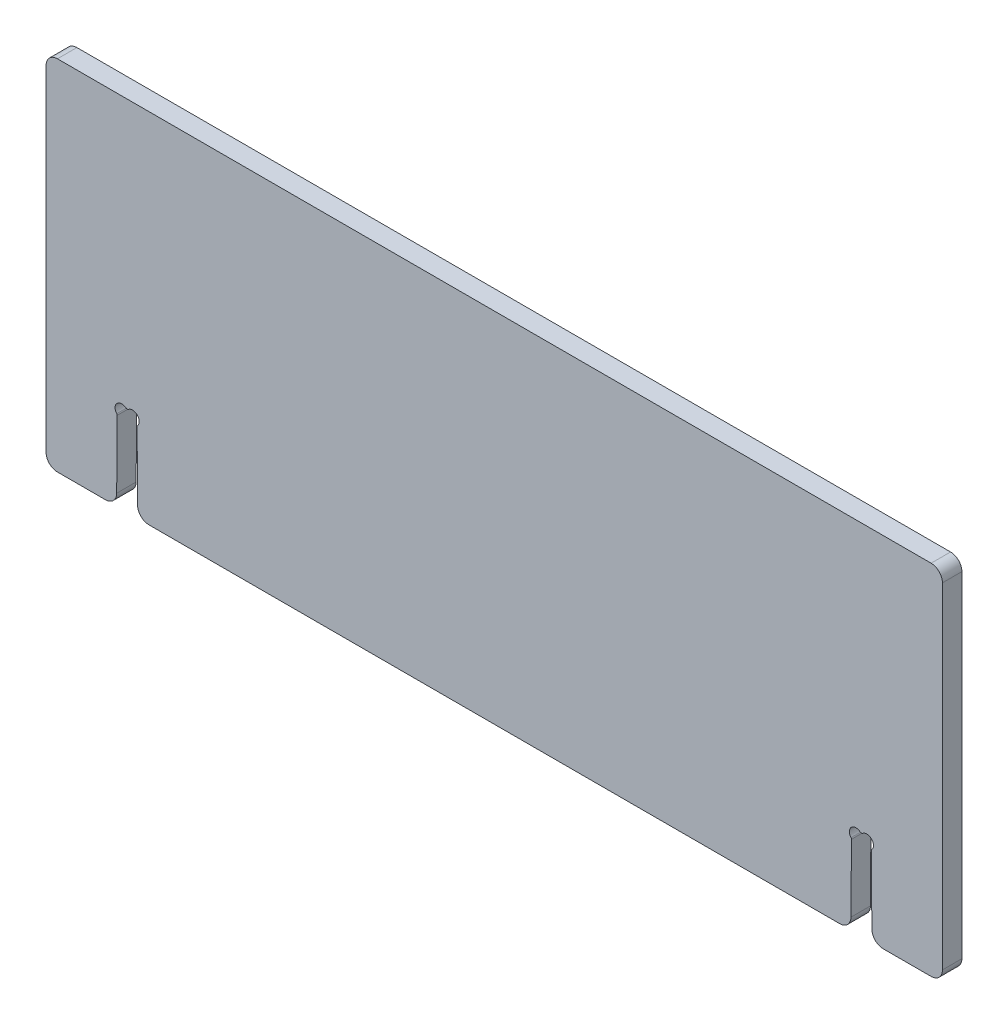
from build123d import *

# Parameters (mm, degrees)
ESQUISSE1_W         = 276.5
ESQUISSE1_H         = 220.8
BOSS_EXTRUDE1_DEPTH = 12
CUT_EXTRUDE1_DEPTH  = 355.046451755
CONG_1_R            = 7


with BuildPart() as part:
    # Esquisse1 → Boss-Extrude1 (new body)
    with BuildSketch(Plane.XY):
        with Locations((138.25, 110.4)):
            Rectangle(ESQUISSE1_W, ESQUISSE1_H)
    extrude(amount=BOSS_EXTRUDE1_DEPTH)

    # Esquisse2 → Cut-Extrude1 (cut, through all)
    with BuildSketch(Plane.XY.offset(12)):
        with BuildLine():
            Line((49.867332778, 55.2), (50.132667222, 55.2))
            ThreePointArc((50.132667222, 55.2), (50.514806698, 55.262472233), (50.857157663, 55.443384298))
            ThreePointArc((50.857157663, 55.443384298), (56.321786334, 54.981041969), (56.438077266, 49.498122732))
            ThreePointArc((56.438077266, 49.498122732), (56.220633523, 49.128471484), (56.147058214, 48.705966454))
            Line((56.147058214, 48.705966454), (56.5, 0))
            Line((56.5, 0), (43.5, 0))
            Line((43.5, 0), (43.852941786, 48.705966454))
            ThreePointArc((43.852941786, 48.705966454), (43.779366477, 49.128471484), (43.561922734, 49.498122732))
            ThreePointArc((43.561922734, 49.498122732), (43.678213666, 54.981041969), (49.142842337, 55.443384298))
            ThreePointArc((49.142842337, 55.443384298), (49.485193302, 55.262472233), (49.867332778, 55.2))
        make_face()
    extrude(amount=-CUT_EXTRUDE1_DEPTH, mode=Mode.SUBTRACT)

    # Cong_1
    cong_1_edges = [part.edges().sort_by_distance(p)[0] for p in [
        (56.5, 0, 6),
        (43.5, 0, 6),
        (0, 220.8, 6),
        (0, 0, 6),
    ]]
    fillet(cong_1_edges, radius=CONG_1_R)

    # Sym_trie1: part across plane


with BuildPart() as part_1:
    add(part.part)
    add(part.part.mirror(Plane(origin=(276.5, 0, 12), x_dir=(0, 0, 1), z_dir=(-1, 0, 0))))


solid = part_1.part
